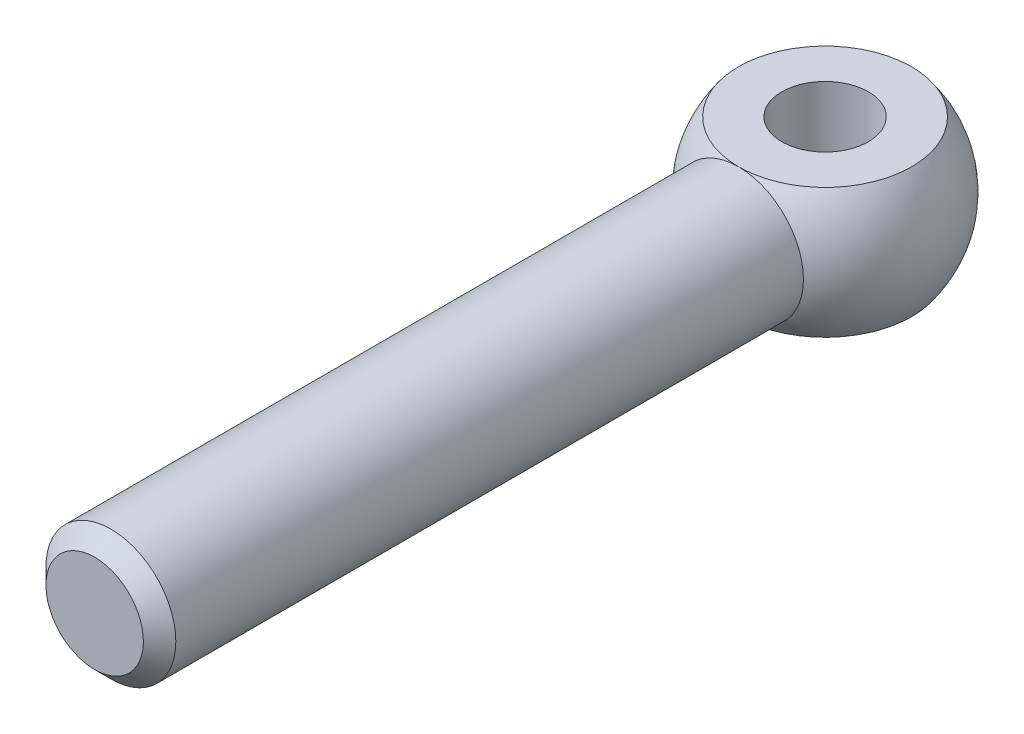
ISO-10303-21;
HEADER;
FILE_DESCRIPTION(('STEP AP214'),'2;1');
FILE_NAME('part.step','',(''),(''),'','','');
FILE_SCHEMA(('AUTOMOTIVE_DESIGN { 1 0 10303 214 1 1 1 1 }'));
ENDSEC;
DATA;
#1=APPLICATION_CONTEXT('core data for automotive mechanical design processes');
#2=APPLICATION_PROTOCOL_DEFINITION('international standard','automotive_design',2000,#1);
#3=PRODUCT_CONTEXT('',#1,'mechanical');
#4=PRODUCT('Part','Part','',(#3));
#5=PRODUCT_RELATED_PRODUCT_CATEGORY('part','',(#4));
#6=PRODUCT_DEFINITION_FORMATION('','',#4);
#7=PRODUCT_DEFINITION_CONTEXT('part definition',#1,'design');
#8=PRODUCT_DEFINITION('design','',#6,#7);
#9=PRODUCT_DEFINITION_SHAPE('','',#8);
#10=(LENGTH_UNIT() NAMED_UNIT(*) SI_UNIT(.MILLI.,.METRE.));
#11=(NAMED_UNIT(*) PLANE_ANGLE_UNIT() SI_UNIT($,.RADIAN.));
#12=(NAMED_UNIT(*) SI_UNIT($,.STERADIAN.) SOLID_ANGLE_UNIT());
#13=UNCERTAINTY_MEASURE_WITH_UNIT(LENGTH_MEASURE(1.E-05),#10,'distance_accuracy_value','');
#14=(GEOMETRIC_REPRESENTATION_CONTEXT(3) GLOBAL_UNCERTAINTY_ASSIGNED_CONTEXT((#13)) GLOBAL_UNIT_ASSIGNED_CONTEXT((#10,
#11,#12)) REPRESENTATION_CONTEXT('',''));
#15=CARTESIAN_POINT('',(0.,0.,0.));
#16=DIRECTION('',(0.,0.,1.));
#17=DIRECTION('',(1.,0.,0.));
#18=AXIS2_PLACEMENT_3D('',#15,#16,#17);
#19=CARTESIAN_POINT('',(0.,1.32360807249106,0.));
#20=DIRECTION('',(0.,1.,0.));
#21=DIRECTION('',(-1.,0.,0.));
#22=AXIS2_PLACEMENT_3D('',#19,#20,#21);
#23=CYLINDRICAL_SURFACE('',#22,8.);
#24=CARTESIAN_POINT('',(0.,-10.6763919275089,0.));
#25=DIRECTION('',(0.,1.,0.));
#26=DIRECTION('',(-1.,0.,0.));
#27=AXIS2_PLACEMENT_3D('',#24,#25,#26);
#28=CIRCLE('',#27,8.);
#29=CARTESIAN_POINT('',(-8.,-10.6763919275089,0.));
#30=VERTEX_POINT('',#29);
#31=EDGE_CURVE('E149',#30,#30,#28,.T.);
#32=ORIENTED_EDGE('',*,*,#31,.F.);
#33=EDGE_LOOP('',(#32));
#34=FACE_BOUND('',#33,.T.);
#35=CARTESIAN_POINT('',(0.,13.3236080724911,0.));
#36=DIRECTION('',(0.,1.,0.));
#37=DIRECTION('',(-1.,0.,0.));
#38=AXIS2_PLACEMENT_3D('',#35,#36,#37);
#39=CIRCLE('',#38,8.);
#40=CARTESIAN_POINT('',(-8.,13.3236080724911,0.));
#41=VERTEX_POINT('',#40);
#42=EDGE_CURVE('E151',#41,#41,#39,.F.);
#43=ORIENTED_EDGE('',*,*,#42,.F.);
#44=EDGE_LOOP('',(#43));
#45=FACE_BOUND('',#44,.T.);
#46=ADVANCED_FACE('F16',(#34,#45),#23,.F.);
#47=CARTESIAN_POINT('',(-12.,13.3236080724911,0.));
#48=DIRECTION('',(0.,1.,0.));
#49=DIRECTION('',(0.,0.,1.));
#50=AXIS2_PLACEMENT_3D('',#47,#48,#49);
#51=PLANE('',#50);
#52=ORIENTED_EDGE('',*,*,#42,.T.);
#53=EDGE_LOOP('',(#52));
#54=FACE_BOUND('',#53,.T.);
#55=CARTESIAN_POINT('',(0.,13.3236080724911,16.));
#56=CARTESIAN_POINT('',(-0.449525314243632,13.3236080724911,16.000003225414));
#57=CARTESIAN_POINT('',(-0.898997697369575,13.3236080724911,15.9810478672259));
#58=CARTESIAN_POINT('',(-1.79489771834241,13.3236080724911,15.9053587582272));
#59=CARTESIAN_POINT('',(-2.24132452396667,13.3236080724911,15.8486150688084));
#60=CARTESIAN_POINT('',(-3.12828472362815,13.3236080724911,15.697657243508));
#61=CARTESIAN_POINT('',(-3.56881125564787,13.3236080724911,15.6034028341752));
#62=CARTESIAN_POINT('',(-4.44035188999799,13.3236080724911,15.3780965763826));
#63=CARTESIAN_POINT('',(-4.87136602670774,13.3236080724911,15.247044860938));
#64=CARTESIAN_POINT('',(-5.72060724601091,13.3236080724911,14.9491486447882));
#65=CARTESIAN_POINT('',(-6.13884041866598,13.3236080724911,14.7823215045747));
#66=CARTESIAN_POINT('',(-6.95977089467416,13.3236080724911,14.4140204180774));
#67=CARTESIAN_POINT('',(-7.36246795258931,13.3236080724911,14.2125459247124));
#68=CARTESIAN_POINT('',(-8.14935486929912,13.3236080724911,13.7764403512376));
#69=CARTESIAN_POINT('',(-8.5335494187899,13.3236080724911,13.5418177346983));
#70=CARTESIAN_POINT('',(-9.28080899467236,13.3236080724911,13.0410458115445));
#71=CARTESIAN_POINT('',(-9.64387410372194,13.3236080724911,12.7748966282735));
#72=CARTESIAN_POINT('',(-10.3463332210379,13.3236080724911,12.2129326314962));
#73=CARTESIAN_POINT('',(-10.68572470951,13.3236080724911,11.9171146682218));
#74=CARTESIAN_POINT('',(-11.338381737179,13.3236080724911,11.2979393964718));
#75=CARTESIAN_POINT('',(-11.6516472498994,13.3236080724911,10.974582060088));
#76=CARTESIAN_POINT('',(-12.2498365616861,13.3236080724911,10.3026139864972));
#77=CARTESIAN_POINT('',(-12.5347592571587,13.3236080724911,9.95400226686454));
#78=CARTESIAN_POINT('',(-13.0742233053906,13.3236080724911,9.23401514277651));
#79=CARTESIAN_POINT('',(-13.3287646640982,13.3236080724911,8.86263974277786));
#80=CARTESIAN_POINT('',(-13.8056519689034,13.3236080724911,8.09977264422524));
#81=CARTESIAN_POINT('',(-14.0279985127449,13.3236080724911,7.70828131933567));
#82=CARTESIAN_POINT('',(-14.4389210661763,13.3236080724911,6.90795929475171));
#83=CARTESIAN_POINT('',(-14.6274970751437,13.3236080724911,6.49912859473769));
#84=CARTESIAN_POINT('',(-14.9695375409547,13.3236080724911,5.66703521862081));
#85=CARTESIAN_POINT('',(-15.1230020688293,13.3236080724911,5.243772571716));
#86=CARTESIAN_POINT('',(-15.3937290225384,13.3236080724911,4.38582365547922));
#87=CARTESIAN_POINT('',(-15.5109914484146,13.3236080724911,3.95113738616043));
#88=CARTESIAN_POINT('',(-15.7084807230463,13.3236080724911,3.07343073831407));
#89=CARTESIAN_POINT('',(-15.7887075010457,13.3236080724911,2.63041034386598));
#90=CARTESIAN_POINT('',(-15.9115547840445,13.3236080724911,1.73918586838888));
#91=CARTESIAN_POINT('',(-15.9541752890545,13.3236080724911,1.29098178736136));
#92=CARTESIAN_POINT('',(-16.0015069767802,13.3236080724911,0.392577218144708));
#93=CARTESIAN_POINT('',(-16.0062182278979,13.3236080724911,-0.0576232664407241));
#94=CARTESIAN_POINT('',(-15.9776980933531,13.3236080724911,-0.956820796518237));
#95=CARTESIAN_POINT('',(-15.9444667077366,13.3236080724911,-1.40581784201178));
#96=CARTESIAN_POINT('',(-15.8402975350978,13.3236080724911,-2.29941656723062));
#97=CARTESIAN_POINT('',(-15.7693597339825,13.3236080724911,-2.74401824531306));
#98=CARTESIAN_POINT('',(-15.5902820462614,13.3236080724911,-3.62566521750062));
#99=CARTESIAN_POINT('',(-15.4821421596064,13.3236080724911,-4.06271051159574));
#100=CARTESIAN_POINT('',(-15.2294289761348,13.3236080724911,-4.92613804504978));
#101=CARTESIAN_POINT('',(-15.0848556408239,13.3236080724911,-5.35252027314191));
#102=CARTESIAN_POINT('',(-14.7603034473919,13.3236080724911,-6.19158987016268));
#103=CARTESIAN_POINT('',(-14.5803245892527,13.3236080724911,-6.60427723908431));
#104=CARTESIAN_POINT('',(-14.1862409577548,13.3236080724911,-7.41302302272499));
#105=CARTESIAN_POINT('',(-13.9721361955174,13.3236080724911,-7.80908144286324));
#106=CARTESIAN_POINT('',(-13.5113228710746,13.3236080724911,-8.58175373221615));
#107=CARTESIAN_POINT('',(-13.2646143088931,13.3236080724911,-8.95836760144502));
#108=CARTESIAN_POINT('',(-12.7403474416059,13.3236080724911,-9.68947314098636));
#109=CARTESIAN_POINT('',(-12.4627891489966,13.3236080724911,-10.0439648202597));
#110=CARTESIAN_POINT('',(-11.8787960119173,13.3236080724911,-10.7283059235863));
#111=CARTESIAN_POINT('',(-11.5723611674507,13.3236080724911,-11.0581553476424));
#112=CARTESIAN_POINT('',(-10.9327934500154,13.3236080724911,-11.6908669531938));
#113=CARTESIAN_POINT('',(-10.5996605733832,13.3236080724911,-11.9937291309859));
#114=CARTESIAN_POINT('',(-9.90906520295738,13.3236080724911,-12.5703130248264));
#115=CARTESIAN_POINT('',(-9.55160270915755,13.3236080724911,-12.8440347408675));
#116=CARTESIAN_POINT('',(-8.81488940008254,13.3236080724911,-13.3603917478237));
#117=CARTESIAN_POINT('',(-8.43563858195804,13.3236080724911,-13.6030270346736));
#118=CARTESIAN_POINT('',(-7.65804491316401,13.3236080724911,-14.0554861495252));
#119=CARTESIAN_POINT('',(-7.25970206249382,13.3236080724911,-14.2653099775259));
#120=CARTESIAN_POINT('',(-6.44675632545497,13.3236080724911,-14.6506544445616));
#121=CARTESIAN_POINT('',(-6.03215343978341,13.3236080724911,-14.8261750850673));
#122=CARTESIAN_POINT('',(-5.18963519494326,13.3236080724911,-15.1416653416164));
#123=CARTESIAN_POINT('',(-4.7617198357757,13.3236080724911,-15.2816349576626));
#124=CARTESIAN_POINT('',(-3.89561888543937,13.3236080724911,-15.5250280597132));
#125=CARTESIAN_POINT('',(-3.45743329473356,13.3236080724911,-15.6284515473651));
#126=CARTESIAN_POINT('',(-2.57390709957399,13.3236080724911,-15.7980171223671));
#127=CARTESIAN_POINT('',(-2.12856649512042,13.3236080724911,-15.8641592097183));
#128=CARTESIAN_POINT('',(-1.23389637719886,13.3236080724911,-15.9586917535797));
#129=CARTESIAN_POINT('',(-0.784566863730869,13.3236080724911,-15.98708221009));
#130=CARTESIAN_POINT('',(0.114886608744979,13.3236080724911,-16.0059096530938));
#131=CARTESIAN_POINT('',(0.565010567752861,13.3236080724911,-15.9963466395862));
#132=CARTESIAN_POINT('',(1.46285284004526,13.3236080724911,-15.9393351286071));
#133=CARTESIAN_POINT('',(1.91057115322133,13.3236080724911,-15.8918866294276));
#134=CARTESIAN_POINT('',(2.80041910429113,13.3236080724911,-15.7594414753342));
#135=CARTESIAN_POINT('',(3.24254874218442,13.3236080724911,-15.6744448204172));
#136=CARTESIAN_POINT('',(4.11807608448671,13.3236080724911,-15.4675076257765));
#137=CARTESIAN_POINT('',(4.55147378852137,13.3236080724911,-15.3455670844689));
#138=CARTESIAN_POINT('',(5.40645604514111,13.3236080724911,-15.0656090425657));
#139=CARTESIAN_POINT('',(5.82804059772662,13.3236080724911,-14.9075915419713));
#140=CARTESIAN_POINT('',(6.65639928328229,13.3236080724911,-14.5566030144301));
#141=CARTESIAN_POINT('',(7.06317341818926,13.3236080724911,-14.3636319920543));
#142=CARTESIAN_POINT('',(7.85901940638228,13.3236080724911,-13.9441083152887));
#143=CARTESIAN_POINT('',(8.24809125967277,13.3236080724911,-13.7175556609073));
#144=CARTESIAN_POINT('',(9.00576656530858,13.3236080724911,-13.2324794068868));
#145=CARTESIAN_POINT('',(9.37437002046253,13.3236080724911,-12.9739558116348));
#146=CARTESIAN_POINT('',(10.0884880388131,13.3236080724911,-12.426775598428));
#147=CARTESIAN_POINT('',(10.4340026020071,13.3236080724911,-12.1381189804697));
#148=CARTESIAN_POINT('',(11.0994865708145,13.3236080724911,-11.532724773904));
#149=CARTESIAN_POINT('',(11.4194559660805,13.3236080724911,-11.2159871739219));
#150=CARTESIAN_POINT('',(12.0315746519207,13.3236080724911,-10.5566829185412));
#151=CARTESIAN_POINT('',(12.3237239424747,13.3236080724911,-10.2141162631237));
#152=CARTESIAN_POINT('',(12.8781255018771,13.3236080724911,-9.50558922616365));
#153=CARTESIAN_POINT('',(13.1403777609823,13.3236080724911,-9.13962883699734));
#154=CARTESIAN_POINT('',(13.6331206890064,13.3236080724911,-8.38691619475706));
#155=CARTESIAN_POINT('',(13.8636113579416,13.3236080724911,-8.00016394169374));
#156=CARTESIAN_POINT('',(14.2911922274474,13.3236080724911,-7.2086175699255));
#157=CARTESIAN_POINT('',(14.4882824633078,13.3236080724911,-6.80382347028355));
#158=CARTESIAN_POINT('',(14.8476615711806,13.3236080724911,-5.9790708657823));
#159=CARTESIAN_POINT('',(15.009950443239,13.3236080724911,-5.55911236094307));
#160=CARTESIAN_POINT('',(15.2985729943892,13.3236080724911,-4.70701675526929));
#161=CARTESIAN_POINT('',(15.4249066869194,13.3236080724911,-4.27487965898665));
#162=CARTESIAN_POINT('',(15.6407208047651,13.3236080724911,-3.40149895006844));
#163=CARTESIAN_POINT('',(15.7302012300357,13.3236080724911,-2.96025533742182));
#164=CARTESIAN_POINT('',(15.8716727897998,13.3236080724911,-2.07179776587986));
#165=CARTESIAN_POINT('',(15.9236638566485,13.3236080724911,-1.62458379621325));
#166=CARTESIAN_POINT('',(15.9897868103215,13.3236080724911,-0.727365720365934));
#167=CARTESIAN_POINT('',(16.003918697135,13.3236080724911,-0.277361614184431));
#168=CARTESIAN_POINT('',(15.9942228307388,13.3236080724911,0.622236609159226));
#169=CARTESIAN_POINT('',(15.97039515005,13.3236080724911,1.07183072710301));
#170=CARTESIAN_POINT('',(15.8849496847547,13.3236080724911,1.96741349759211));
#171=CARTESIAN_POINT('',(15.8233319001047,13.3236080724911,2.41340215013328));
#172=CARTESIAN_POINT('',(15.6627441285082,13.3236080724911,3.29860418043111));
#173=CARTESIAN_POINT('',(15.563774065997,13.3236080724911,3.73781754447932));
#174=CARTESIAN_POINT('',(15.3291853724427,13.3236080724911,4.60634551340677));
#175=CARTESIAN_POINT('',(15.1935667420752,13.3236080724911,5.03566011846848));
#176=CARTESIAN_POINT('',(14.8866422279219,13.3236080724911,5.88134626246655));
#177=CARTESIAN_POINT('',(14.7153356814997,13.3236080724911,6.29771756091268));
#178=CARTESIAN_POINT('',(14.3382547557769,13.3236080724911,7.11454856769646));
#179=CARTESIAN_POINT('',(14.1324803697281,13.3236080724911,7.51500827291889));
#180=CARTESIAN_POINT('',(13.6879354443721,13.3236080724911,8.29715362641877));
#181=CARTESIAN_POINT('',(13.4491661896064,13.3236080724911,8.67884000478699));
#182=CARTESIAN_POINT('',(12.9403231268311,13.3236080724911,9.42074158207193));
#183=CARTESIAN_POINT('',(12.6702493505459,13.3236080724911,9.78095680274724));
#184=CARTESIAN_POINT('',(12.1007473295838,13.3236080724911,10.4773186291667));
#185=CARTESIAN_POINT('',(11.8013222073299,13.3236080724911,10.8134677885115));
#186=CARTESIAN_POINT('',(11.175220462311,13.3236080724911,11.4593516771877));
#187=CARTESIAN_POINT('',(10.8485437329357,13.3236080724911,11.769086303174));
#188=CARTESIAN_POINT('',(10.1701750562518,13.3236080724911,12.3600135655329));
#189=CARTESIAN_POINT('',(9.81847675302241,13.3236080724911,12.6411989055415));
#190=CARTESIAN_POINT('',(9.09264578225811,13.3236080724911,13.1729337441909));
#191=CARTESIAN_POINT('',(8.71851346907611,13.3236080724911,13.4234837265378));
#192=CARTESIAN_POINT('',(7.95028297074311,13.3236080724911,13.8922850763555));
#193=CARTESIAN_POINT('',(7.5561752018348,13.3236080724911,14.1105207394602));
#194=CARTESIAN_POINT('',(6.75096709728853,13.3236080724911,14.5129954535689));
#195=CARTESIAN_POINT('',(6.33986670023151,13.3236080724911,14.6972343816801));
#196=CARTESIAN_POINT('',(5.50404141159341,13.3236080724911,15.0302249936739));
#197=CARTESIAN_POINT('',(5.07933164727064,13.3236080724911,15.1790146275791));
#198=CARTESIAN_POINT('',(4.21903350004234,13.3236080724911,15.4402669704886));
#199=CARTESIAN_POINT('',(3.78344800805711,13.3236080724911,15.5527392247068));
#200=CARTESIAN_POINT('',(2.7948527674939,13.3236080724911,15.7640042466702));
#201=CARTESIAN_POINT('',(2.23959667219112,13.3236080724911,15.8524275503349));
#202=CARTESIAN_POINT('',(1.12286620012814,13.3236080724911,15.970423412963));
#203=CARTESIAN_POINT('',(0.561391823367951,13.3236080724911,15.9999959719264));
#204=CARTESIAN_POINT('',(0.,13.3236080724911,16.));
#205=B_SPLINE_CURVE_WITH_KNOTS('',3,(#55,#56,#57,#58,#59,#60,#61,#62,#63,#64,#65,#66,#67,#68,
#69,#70,#71,#72,#73,#74,#75,#76,#77,#78,#79,#80,#81,#82,#83,#84,#85,#86,#87,#88,#89,#90,#91,#92,
#93,#94,#95,#96,#97,#98,#99,#100,#101,#102,#103,#104,#105,#106,#107,#108,#109,#110,#111,#112,
#113,#114,#115,#116,#117,#118,#119,#120,#121,#122,#123,#124,#125,#126,#127,#128,#129,#130,#131,
#132,#133,#134,#135,#136,#137,#138,#139,#140,#141,#142,#143,#144,#145,#146,#147,#148,#149,#150,
#151,#152,#153,#154,#155,#156,#157,#158,#159,#160,#161,#162,#163,#164,#165,#166,#167,#168,#169,
#170,#171,#172,#173,#174,#175,#176,#177,#178,#179,#180,#181,#182,#183,#184,#185,#186,#187,#188,
#189,#190,#191,#192,#193,#194,#195,#196,#197,#198,#199,#200,#201,#202,#203,#204),.UNSPECIFIED.,
.T.,.F.,(4,2,2,2,2,2,2,2,2,2,2,2,2,2,2,2,2,2,2,2,2,2,2,2,2,2,2,2,2,2,2,2,2,2,2,2,2,2,2,2,2,2,2,
2,2,2,2,2,2,2,2,2,2,2,2,2,2,2,2,2,2,2,2,2,2,2,2,2,2,2,2,2,2,2,4),(0.,1.34808556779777,
2.69652583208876,4.04641777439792,5.39630483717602,6.74553832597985,8.09479312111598,
9.44370403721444,10.7926096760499,12.1416586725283,13.4907090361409,14.839811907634,
16.1889145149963,17.5379920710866,18.8870696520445,20.2361445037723,21.5852193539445,
22.9342967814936,24.2833742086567,25.6324492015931,26.9815241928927,28.3305996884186,
29.67967518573,31.0287521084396,32.3778290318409,33.7269055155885,35.0759819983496,
36.4250579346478,37.7741338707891,39.1232099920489,40.4722861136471,41.8213624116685,
43.1704387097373,44.5195149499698,45.8685911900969,47.2176673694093,48.5667435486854,
49.9158197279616,51.264895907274,52.6139721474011,53.9630483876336,55.3121246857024,
56.6612009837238,58.010277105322,59.3593532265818,60.7084291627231,62.0575050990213,
63.4065815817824,64.75565806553,66.1047349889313,67.4538119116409,68.8028874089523,
70.1519629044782,71.5010378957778,72.8501128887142,74.1991903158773,75.5482677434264,
76.8973425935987,78.2464174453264,79.5954950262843,80.9445725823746,82.2936751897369,
83.64277806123,84.9918284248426,86.340877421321,87.6897830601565,89.0386939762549,
90.3879487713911,91.7371822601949,93.087069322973,94.4369612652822,95.7854015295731,
97.1334870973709,98.8170501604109,100.500613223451),.UNSPECIFIED.);
#206=CARTESIAN_POINT('',(0.,13.3236080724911,16.));
#207=VERTEX_POINT('',#206);
#208=EDGE_CURVE('E52',#207,#207,#205,.T.);
#209=ORIENTED_EDGE('',*,*,#208,.F.);
#210=EDGE_LOOP('',(#209));
#211=FACE_BOUND('',#210,.T.);
#212=ADVANCED_FACE('F118',(#54,#211),#51,.T.);
#213=CARTESIAN_POINT('',(-12.,-10.6763919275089,0.));
#214=DIRECTION('',(0.,-1.,0.));
#215=DIRECTION('',(0.,0.,-1.));
#216=AXIS2_PLACEMENT_3D('',#213,#214,#215);
#217=PLANE('',#216);
#218=ORIENTED_EDGE('',*,*,#31,.T.);
#219=EDGE_LOOP('',(#218));
#220=FACE_BOUND('',#219,.T.);
#221=CARTESIAN_POINT('',(0.,-10.6763919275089,16.));
#222=CARTESIAN_POINT('',(0.449525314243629,-10.6763919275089,16.000003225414));
#223=CARTESIAN_POINT('',(0.898997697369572,-10.6763919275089,15.9810478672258));
#224=CARTESIAN_POINT('',(1.79489771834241,-10.6763919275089,15.9053587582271));
#225=CARTESIAN_POINT('',(2.24132452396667,-10.6763919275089,15.8486150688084));
#226=CARTESIAN_POINT('',(3.12828472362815,-10.6763919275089,15.697657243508));
#227=CARTESIAN_POINT('',(3.56881125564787,-10.6763919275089,15.6034028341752));
#228=CARTESIAN_POINT('',(4.44035188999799,-10.6763919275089,15.3780965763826));
#229=CARTESIAN_POINT('',(4.87136602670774,-10.6763919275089,15.247044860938));
#230=CARTESIAN_POINT('',(5.72060724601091,-10.6763919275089,14.9491486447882));
#231=CARTESIAN_POINT('',(6.13884041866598,-10.6763919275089,14.7823215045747));
#232=CARTESIAN_POINT('',(6.95977089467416,-10.6763919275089,14.4140204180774));
#233=CARTESIAN_POINT('',(7.36246795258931,-10.6763919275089,14.2125459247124));
#234=CARTESIAN_POINT('',(8.14935486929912,-10.6763919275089,13.7764403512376));
#235=CARTESIAN_POINT('',(8.5335494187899,-10.6763919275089,13.5418177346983));
#236=CARTESIAN_POINT('',(9.28080899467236,-10.6763919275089,13.0410458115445));
#237=CARTESIAN_POINT('',(9.64387410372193,-10.6763919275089,12.7748966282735));
#238=CARTESIAN_POINT('',(10.3463332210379,-10.6763919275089,12.2129326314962));
#239=CARTESIAN_POINT('',(10.6857247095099,-10.6763919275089,11.9171146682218));
#240=CARTESIAN_POINT('',(11.338381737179,-10.6763919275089,11.2979393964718));
#241=CARTESIAN_POINT('',(11.6516472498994,-10.6763919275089,10.974582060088));
#242=CARTESIAN_POINT('',(12.2498365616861,-10.6763919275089,10.3026139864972));
#243=CARTESIAN_POINT('',(12.5347592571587,-10.6763919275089,9.95400226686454));
#244=CARTESIAN_POINT('',(13.0742233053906,-10.6763919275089,9.2340151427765));
#245=CARTESIAN_POINT('',(13.3287646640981,-10.6763919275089,8.86263974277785));
#246=CARTESIAN_POINT('',(13.8056519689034,-10.6763919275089,8.09977264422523));
#247=CARTESIAN_POINT('',(14.0279985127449,-10.6763919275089,7.70828131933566));
#248=CARTESIAN_POINT('',(14.4389210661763,-10.6763919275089,6.9079592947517));
#249=CARTESIAN_POINT('',(14.6274970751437,-10.6763919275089,6.49912859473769));
#250=CARTESIAN_POINT('',(14.9695375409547,-10.6763919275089,5.66703521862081));
#251=CARTESIAN_POINT('',(15.1230020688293,-10.6763919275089,5.24377257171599));
#252=CARTESIAN_POINT('',(15.3937290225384,-10.6763919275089,4.38582365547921));
#253=CARTESIAN_POINT('',(15.5109914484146,-10.6763919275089,3.95113738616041));
#254=CARTESIAN_POINT('',(15.7084807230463,-10.6763919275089,3.07343073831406));
#255=CARTESIAN_POINT('',(15.7887075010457,-10.6763919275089,2.63041034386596));
#256=CARTESIAN_POINT('',(15.9115547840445,-10.6763919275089,1.73918586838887));
#257=CARTESIAN_POINT('',(15.9541752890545,-10.6763919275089,1.29098178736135));
#258=CARTESIAN_POINT('',(16.0015069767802,-10.6763919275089,0.392577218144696));
#259=CARTESIAN_POINT('',(16.0062182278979,-10.6763919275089,-0.0576232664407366));
#260=CARTESIAN_POINT('',(15.9776980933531,-10.6763919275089,-0.956820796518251));
#261=CARTESIAN_POINT('',(15.9444667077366,-10.6763919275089,-1.40581784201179));
#262=CARTESIAN_POINT('',(15.8402975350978,-10.6763919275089,-2.29941656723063));
#263=CARTESIAN_POINT('',(15.7693597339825,-10.6763919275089,-2.74401824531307));
#264=CARTESIAN_POINT('',(15.5902820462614,-10.6763919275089,-3.62566521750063));
#265=CARTESIAN_POINT('',(15.4821421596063,-10.6763919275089,-4.06271051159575));
#266=CARTESIAN_POINT('',(15.2294289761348,-10.6763919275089,-4.92613804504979));
#267=CARTESIAN_POINT('',(15.0848556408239,-10.6763919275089,-5.35252027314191));
#268=CARTESIAN_POINT('',(14.7603034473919,-10.6763919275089,-6.19158987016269));
#269=CARTESIAN_POINT('',(14.5803245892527,-10.6763919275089,-6.60427723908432));
#270=CARTESIAN_POINT('',(14.1862409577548,-10.6763919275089,-7.413023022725));
#271=CARTESIAN_POINT('',(13.9721361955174,-10.6763919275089,-7.80908144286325));
#272=CARTESIAN_POINT('',(13.5113228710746,-10.6763919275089,-8.58175373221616));
#273=CARTESIAN_POINT('',(13.264614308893,-10.6763919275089,-8.95836760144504));
#274=CARTESIAN_POINT('',(12.7403474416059,-10.6763919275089,-9.68947314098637));
#275=CARTESIAN_POINT('',(12.4627891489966,-10.6763919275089,-10.0439648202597));
#276=CARTESIAN_POINT('',(11.8787960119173,-10.6763919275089,-10.7283059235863));
#277=CARTESIAN_POINT('',(11.5723611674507,-10.6763919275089,-11.0581553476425));
#278=CARTESIAN_POINT('',(10.9327934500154,-10.6763919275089,-11.6908669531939));
#279=CARTESIAN_POINT('',(10.5996605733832,-10.6763919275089,-11.9937291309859));
#280=CARTESIAN_POINT('',(9.90906520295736,-10.6763919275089,-12.5703130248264));
#281=CARTESIAN_POINT('',(9.55160270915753,-10.6763919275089,-12.8440347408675));
#282=CARTESIAN_POINT('',(8.81488940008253,-10.6763919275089,-13.3603917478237));
#283=CARTESIAN_POINT('',(8.43563858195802,-10.6763919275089,-13.6030270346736));
#284=CARTESIAN_POINT('',(7.65804491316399,-10.6763919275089,-14.0554861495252));
#285=CARTESIAN_POINT('',(7.2597020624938,-10.6763919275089,-14.2653099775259));
#286=CARTESIAN_POINT('',(6.44675632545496,-10.6763919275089,-14.6506544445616));
#287=CARTESIAN_POINT('',(6.03215343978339,-10.6763919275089,-14.8261750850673));
#288=CARTESIAN_POINT('',(5.18963519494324,-10.6763919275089,-15.1416653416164));
#289=CARTESIAN_POINT('',(4.76171983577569,-10.6763919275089,-15.2816349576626));
#290=CARTESIAN_POINT('',(3.89561888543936,-10.6763919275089,-15.5250280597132));
#291=CARTESIAN_POINT('',(3.45743329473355,-10.6763919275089,-15.6284515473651));
#292=CARTESIAN_POINT('',(2.57390709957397,-10.6763919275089,-15.7980171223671));
#293=CARTESIAN_POINT('',(2.1285664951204,-10.6763919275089,-15.8641592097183));
#294=CARTESIAN_POINT('',(1.23389637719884,-10.6763919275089,-15.9586917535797));
#295=CARTESIAN_POINT('',(0.784566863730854,-10.6763919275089,-15.98708221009));
#296=CARTESIAN_POINT('',(-0.114886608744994,-10.6763919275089,-16.0059096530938));
#297=CARTESIAN_POINT('',(-0.565010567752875,-10.6763919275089,-15.9963466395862));
#298=CARTESIAN_POINT('',(-1.46285284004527,-10.6763919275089,-15.9393351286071));
#299=CARTESIAN_POINT('',(-1.91057115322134,-10.6763919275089,-15.8918866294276));
#300=CARTESIAN_POINT('',(-2.80041910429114,-10.6763919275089,-15.7594414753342));
#301=CARTESIAN_POINT('',(-3.24254874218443,-10.6763919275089,-15.6744448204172));
#302=CARTESIAN_POINT('',(-4.11807608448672,-10.6763919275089,-15.4675076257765));
#303=CARTESIAN_POINT('',(-4.55147378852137,-10.6763919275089,-15.3455670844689));
#304=CARTESIAN_POINT('',(-5.40645604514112,-10.6763919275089,-15.0656090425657));
#305=CARTESIAN_POINT('',(-5.82804059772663,-10.6763919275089,-14.9075915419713));
#306=CARTESIAN_POINT('',(-6.6563992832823,-10.6763919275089,-14.5566030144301));
#307=CARTESIAN_POINT('',(-7.06317341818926,-10.6763919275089,-14.3636319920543));
#308=CARTESIAN_POINT('',(-7.85901940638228,-10.6763919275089,-13.9441083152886));
#309=CARTESIAN_POINT('',(-8.24809125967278,-10.6763919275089,-13.7175556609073));
#310=CARTESIAN_POINT('',(-9.00576656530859,-10.6763919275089,-13.2324794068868));
#311=CARTESIAN_POINT('',(-9.37437002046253,-10.6763919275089,-12.9739558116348));
#312=CARTESIAN_POINT('',(-10.0884880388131,-10.6763919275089,-12.426775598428));
#313=CARTESIAN_POINT('',(-10.4340026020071,-10.6763919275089,-12.1381189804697));
#314=CARTESIAN_POINT('',(-11.0994865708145,-10.6763919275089,-11.532724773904));
#315=CARTESIAN_POINT('',(-11.4194559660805,-10.6763919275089,-11.2159871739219));
#316=CARTESIAN_POINT('',(-12.0315746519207,-10.6763919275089,-10.5566829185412));
#317=CARTESIAN_POINT('',(-12.3237239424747,-10.6763919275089,-10.2141162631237));
#318=CARTESIAN_POINT('',(-12.8781255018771,-10.6763919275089,-9.50558922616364));
#319=CARTESIAN_POINT('',(-13.1403777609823,-10.6763919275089,-9.13962883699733));
#320=CARTESIAN_POINT('',(-13.6331206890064,-10.6763919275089,-8.38691619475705));
#321=CARTESIAN_POINT('',(-13.8636113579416,-10.6763919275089,-8.00016394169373));
#322=CARTESIAN_POINT('',(-14.2911922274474,-10.6763919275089,-7.20861756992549));
#323=CARTESIAN_POINT('',(-14.4882824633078,-10.6763919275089,-6.80382347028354));
#324=CARTESIAN_POINT('',(-14.8476615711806,-10.6763919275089,-5.97907086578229));
#325=CARTESIAN_POINT('',(-15.009950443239,-10.6763919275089,-5.55911236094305));
#326=CARTESIAN_POINT('',(-15.2985729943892,-10.6763919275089,-4.70701675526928));
#327=CARTESIAN_POINT('',(-15.4249066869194,-10.6763919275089,-4.27487965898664));
#328=CARTESIAN_POINT('',(-15.6407208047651,-10.6763919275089,-3.40149895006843));
#329=CARTESIAN_POINT('',(-15.7302012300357,-10.6763919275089,-2.96025533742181));
#330=CARTESIAN_POINT('',(-15.8716727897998,-10.6763919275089,-2.07179776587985));
#331=CARTESIAN_POINT('',(-15.9236638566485,-10.6763919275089,-1.62458379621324));
#332=CARTESIAN_POINT('',(-15.9897868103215,-10.6763919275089,-0.727365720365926));
#333=CARTESIAN_POINT('',(-16.003918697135,-10.6763919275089,-0.277361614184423));
#334=CARTESIAN_POINT('',(-15.9942228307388,-10.6763919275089,0.622236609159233));
#335=CARTESIAN_POINT('',(-15.97039515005,-10.6763919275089,1.07183072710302));
#336=CARTESIAN_POINT('',(-15.8849496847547,-10.6763919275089,1.96741349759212));
#337=CARTESIAN_POINT('',(-15.8233319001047,-10.6763919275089,2.41340215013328));
#338=CARTESIAN_POINT('',(-15.6627441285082,-10.6763919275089,3.29860418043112));
#339=CARTESIAN_POINT('',(-15.563774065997,-10.6763919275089,3.73781754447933));
#340=CARTESIAN_POINT('',(-15.3291853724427,-10.6763919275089,4.60634551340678));
#341=CARTESIAN_POINT('',(-15.1935667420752,-10.6763919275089,5.03566011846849));
#342=CARTESIAN_POINT('',(-14.8866422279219,-10.6763919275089,5.88134626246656));
#343=CARTESIAN_POINT('',(-14.7153356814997,-10.6763919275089,6.29771756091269));
#344=CARTESIAN_POINT('',(-14.3382547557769,-10.6763919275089,7.11454856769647));
#345=CARTESIAN_POINT('',(-14.1324803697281,-10.6763919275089,7.51500827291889));
#346=CARTESIAN_POINT('',(-13.6879354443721,-10.6763919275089,8.29715362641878));
#347=CARTESIAN_POINT('',(-13.4491661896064,-10.6763919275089,8.678840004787));
#348=CARTESIAN_POINT('',(-12.9403231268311,-10.6763919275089,9.42074158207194));
#349=CARTESIAN_POINT('',(-12.6702493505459,-10.6763919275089,9.78095680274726));
#350=CARTESIAN_POINT('',(-12.1007473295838,-10.6763919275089,10.4773186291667));
#351=CARTESIAN_POINT('',(-11.8013222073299,-10.6763919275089,10.8134677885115));
#352=CARTESIAN_POINT('',(-11.175220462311,-10.6763919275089,11.4593516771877));
#353=CARTESIAN_POINT('',(-10.8485437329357,-10.6763919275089,11.769086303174));
#354=CARTESIAN_POINT('',(-10.1701750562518,-10.6763919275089,12.3600135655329));
#355=CARTESIAN_POINT('',(-9.81847675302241,-10.6763919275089,12.6411989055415));
#356=CARTESIAN_POINT('',(-9.09264578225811,-10.6763919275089,13.1729337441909));
#357=CARTESIAN_POINT('',(-8.7185134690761,-10.6763919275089,13.4234837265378));
#358=CARTESIAN_POINT('',(-7.9502829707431,-10.6763919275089,13.8922850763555));
#359=CARTESIAN_POINT('',(-7.55617520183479,-10.6763919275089,14.1105207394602));
#360=CARTESIAN_POINT('',(-6.75096709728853,-10.6763919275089,14.5129954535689));
#361=CARTESIAN_POINT('',(-6.3398667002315,-10.6763919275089,14.6972343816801));
#362=CARTESIAN_POINT('',(-5.5040414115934,-10.6763919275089,15.0302249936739));
#363=CARTESIAN_POINT('',(-5.07933164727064,-10.6763919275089,15.1790146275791));
#364=CARTESIAN_POINT('',(-4.21903350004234,-10.6763919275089,15.4402669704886));
#365=CARTESIAN_POINT('',(-3.7834480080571,-10.6763919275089,15.5527392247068));
#366=CARTESIAN_POINT('',(-2.7948527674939,-10.6763919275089,15.7640042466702));
#367=CARTESIAN_POINT('',(-2.23959667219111,-10.6763919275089,15.8524275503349));
#368=CARTESIAN_POINT('',(-1.12286620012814,-10.6763919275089,15.970423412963));
#369=CARTESIAN_POINT('',(-0.561391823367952,-10.6763919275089,15.9999959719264));
#370=CARTESIAN_POINT('',(0.,-10.6763919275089,16.));
#371=B_SPLINE_CURVE_WITH_KNOTS('',3,(#221,#222,#223,#224,#225,#226,#227,#228,#229,#230,#231,
#232,#233,#234,#235,#236,#237,#238,#239,#240,#241,#242,#243,#244,#245,#246,#247,#248,#249,#250,
#251,#252,#253,#254,#255,#256,#257,#258,#259,#260,#261,#262,#263,#264,#265,#266,#267,#268,#269,
#270,#271,#272,#273,#274,#275,#276,#277,#278,#279,#280,#281,#282,#283,#284,#285,#286,#287,#288,
#289,#290,#291,#292,#293,#294,#295,#296,#297,#298,#299,#300,#301,#302,#303,#304,#305,#306,#307,
#308,#309,#310,#311,#312,#313,#314,#315,#316,#317,#318,#319,#320,#321,#322,#323,#324,#325,#326,
#327,#328,#329,#330,#331,#332,#333,#334,#335,#336,#337,#338,#339,#340,#341,#342,#343,#344,#345,
#346,#347,#348,#349,#350,#351,#352,#353,#354,#355,#356,#357,#358,#359,#360,#361,#362,#363,#364,
#365,#366,#367,#368,#369,#370),.UNSPECIFIED.,.T.,.F.,(4,2,2,2,2,2,2,2,2,2,2,2,2,2,2,2,2,2,2,2,2,
2,2,2,2,2,2,2,2,2,2,2,2,2,2,2,2,2,2,2,2,2,2,2,2,2,2,2,2,2,2,2,2,2,2,2,2,2,2,2,2,2,2,2,2,2,2,2,2,
2,2,2,2,2,4),(0.,1.34808556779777,2.69652583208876,4.04641777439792,5.39630483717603,
6.74553832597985,8.09479312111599,9.44370403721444,10.7926096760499,12.1416586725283,
13.4907090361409,14.839811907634,16.1889145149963,17.5379920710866,18.8870696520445,
20.2361445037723,21.5852193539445,22.9342967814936,24.2833742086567,25.6324492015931,
26.9815241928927,28.3305996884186,29.67967518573,31.0287521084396,32.3778290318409,
33.7269055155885,35.0759819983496,36.4250579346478,37.7741338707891,39.1232099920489,
40.4722861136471,41.8213624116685,43.1704387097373,44.5195149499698,45.8685911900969,
47.2176673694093,48.5667435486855,49.9158197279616,51.264895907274,52.6139721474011,
53.9630483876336,55.3121246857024,56.6612009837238,58.010277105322,59.3593532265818,
60.7084291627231,62.0575050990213,63.4065815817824,64.75565806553,66.1047349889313,
67.4538119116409,68.8028874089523,70.1519629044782,71.5010378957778,72.8501128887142,
74.1991903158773,75.5482677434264,76.8973425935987,78.2464174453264,79.5954950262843,
80.9445725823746,82.2936751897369,83.64277806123,84.9918284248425,86.3408774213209,
87.6897830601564,89.0386939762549,90.387948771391,91.7371822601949,93.087069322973,
94.4369612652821,95.7854015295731,97.1334870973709,98.8170501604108,100.500613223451),.UNSPECIFIED.);
#372=CARTESIAN_POINT('',(0.,-10.6763919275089,16.));
#373=VERTEX_POINT('',#372);
#374=EDGE_CURVE('E105',#373,#373,#371,.T.);
#375=ORIENTED_EDGE('',*,*,#374,.F.);
#376=EDGE_LOOP('',(#375));
#377=FACE_BOUND('',#376,.T.);
#378=ADVANCED_FACE('F115',(#220,#377),#217,.T.);
#379=CARTESIAN_POINT('',(0.,1.32360807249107,135.));
#380=DIRECTION('',(0.,0.,-1.));
#381=DIRECTION('',(-1.,0.,0.));
#382=AXIS2_PLACEMENT_3D('',#379,#380,#381);
#383=PLANE('',#382);
#384=CARTESIAN_POINT('',(0.,1.32360807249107,135.000000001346));
#385=DIRECTION('',(0.,0.,-1.));
#386=DIRECTION('',(0.,1.,0.));
#387=AXIS2_PLACEMENT_3D('',#384,#385,#386);
#388=CIRCLE('',#387,9.00000000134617);
#389=CARTESIAN_POINT('',(0.,10.3236080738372,135.000000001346));
#390=VERTEX_POINT('',#389);
#391=EDGE_CURVE('E101',#390,#390,#388,.T.);
#392=ORIENTED_EDGE('',*,*,#391,.F.);
#393=EDGE_LOOP('',(#392));
#394=FACE_BOUND('',#393,.T.);
#395=ADVANCED_FACE('F67',(#394),#383,.F.);
#396=CARTESIAN_POINT('',(0.,1.32360807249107,0.));
#397=DIRECTION('',(1.,0.,0.));
#398=DIRECTION('',(0.,1.,0.));
#399=AXIS2_PLACEMENT_3D('',#396,#397,#398);
#400=SPHERICAL_SURFACE('',#399,20.);
#401=ORIENTED_EDGE('',*,*,#374,.T.);
#402=CARTESIAN_POINT('',(0.,1.32360807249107,16.));
#403=DIRECTION('',(0.,0.,1.));
#404=DIRECTION('',(1.,0.,0.));
#405=AXIS2_PLACEMENT_3D('',#402,#403,#404);
#406=CIRCLE('',#405,12.);
#407=EDGE_CURVE('E96',#207,#373,#406,.T.);
#408=ORIENTED_EDGE('',*,*,#407,.F.);
#409=ORIENTED_EDGE('',*,*,#208,.T.);
#410=CARTESIAN_POINT('',(0.,1.32360807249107,16.));
#411=DIRECTION('',(0.,0.,1.));
#412=DIRECTION('',(1.,0.,0.));
#413=AXIS2_PLACEMENT_3D('',#410,#411,#412);
#414=CIRCLE('',#413,12.);
#415=CARTESIAN_POINT('',(12.,1.32360807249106,16.));
#416=VERTEX_POINT('',#415);
#417=EDGE_CURVE('E37',#416,#207,#414,.T.);
#418=ORIENTED_EDGE('',*,*,#417,.F.);
#419=CARTESIAN_POINT('',(20.,1.32360807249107,0.));
#420=CARTESIAN_POINT('',(20.0000134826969,1.32360807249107,0.386373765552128));
#421=CARTESIAN_POINT('',(19.988804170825,1.32360807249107,0.772746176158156));
#422=CARTESIAN_POINT('',(19.944036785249,1.32360807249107,1.54419430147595));
#423=CARTESIAN_POINT('',(19.9104787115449,1.32360807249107,1.92927001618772));
#424=CARTESIAN_POINT('',(19.8211106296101,1.32360807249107,2.69683076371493));
#425=CARTESIAN_POINT('',(19.7653006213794,1.32360807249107,3.07931579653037));
#426=CARTESIAN_POINT('',(19.631620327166,1.32360807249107,3.84041106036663));
#427=CARTESIAN_POINT('',(19.5537500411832,1.32360807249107,4.21902129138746));
#428=CARTESIAN_POINT('',(19.376209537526,1.32360807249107,4.97109553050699));
#429=CARTESIAN_POINT('',(19.2765393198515,1.32360807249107,5.3445595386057));
#430=CARTESIAN_POINT('',(19.0557339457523,1.32360807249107,6.08508727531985));
#431=CARTESIAN_POINT('',(18.9345987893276,1.32360807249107,6.45215100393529));
#432=CARTESIAN_POINT('',(18.6712702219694,1.32360807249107,7.17864559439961));
#433=CARTESIAN_POINT('',(18.5290768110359,1.32360807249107,7.53807645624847));
#434=CARTESIAN_POINT('',(18.2241092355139,1.32360807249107,8.24809836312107));
#435=CARTESIAN_POINT('',(18.0613350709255,1.32360807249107,8.5986894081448));
#436=CARTESIAN_POINT('',(17.7157525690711,1.32360807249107,9.28985441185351));
#437=CARTESIAN_POINT('',(17.5329442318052,1.32360807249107,9.6304283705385));
#438=CARTESIAN_POINT('',(17.1479072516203,1.32360807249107,10.3004155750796));
#439=CARTESIAN_POINT('',(16.9456786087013,1.32360807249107,10.6298288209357));
#440=CARTESIAN_POINT('',(16.5224800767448,1.32360807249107,11.2763884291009));
#441=CARTESIAN_POINT('',(16.3015101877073,1.32360807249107,11.5935347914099));
#442=CARTESIAN_POINT('',(15.8415712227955,1.32360807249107,12.2144957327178));
#443=CARTESIAN_POINT('',(15.6026021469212,1.32360807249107,12.5183103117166));
#444=CARTESIAN_POINT('',(15.1074670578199,1.32360807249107,13.1115872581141));
#445=CARTESIAN_POINT('',(14.8513010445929,1.32360807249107,13.4010496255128));
#446=CARTESIAN_POINT('',(14.322633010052,1.32360807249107,13.9646510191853));
#447=CARTESIAN_POINT('',(14.050130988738,1.32360807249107,14.2387900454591));
#448=CARTESIAN_POINT('',(13.4897032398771,1.32360807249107,14.7708209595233));
#449=CARTESIAN_POINT('',(13.2017775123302,1.32360807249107,15.0287128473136));
#450=CARTESIAN_POINT('',(12.6114794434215,1.32360807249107,15.5273956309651));
#451=CARTESIAN_POINT('',(12.3091071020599,1.32360807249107,15.7681865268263));
#452=CARTESIAN_POINT('',(12.,1.32360807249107,16.));
#453=B_SPLINE_CURVE_WITH_KNOTS('',3,(#419,#420,#421,#422,#423,#424,#425,#426,#427,#428,#429,
#430,#431,#432,#433,#434,#435,#436,#437,#438,#439,#440,#441,#442,#443,#444,#445,#446,#447,#448,
#449,#450,#451,#452),.UNSPECIFIED.,.F.,.F.,(4,2,2,2,2,2,2,2,2,2,2,2,2,2,2,2,4),(0.,
1.15895680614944,2.31791361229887,3.47687041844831,4.63582722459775,5.79478403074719,
6.95374083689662,8.11269764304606,9.2716544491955,10.4306112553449,11.5895680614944,
12.7485248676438,13.9074816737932,15.0664384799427,16.2253952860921,17.3843520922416,
18.543308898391),.UNSPECIFIED.);
#454=CARTESIAN_POINT('',(20.,1.32360807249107,0.));
#455=VERTEX_POINT('',#454);
#456=EDGE_CURVE('E50',#455,#416,#453,.T.);
#457=ORIENTED_EDGE('',*,*,#456,.F.);
#458=CARTESIAN_POINT('',(-20.,1.32360807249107,0.));
#459=CARTESIAN_POINT('',(-20.0000069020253,1.32360807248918,-0.326779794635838));
#460=CARTESIAN_POINT('',(-19.9919913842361,1.32360807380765,-0.65355900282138));
#461=CARTESIAN_POINT('',(-19.9599650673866,1.32360807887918,-1.30633275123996));
#462=CARTESIAN_POINT('',(-19.9359542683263,1.32360808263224,-1.632327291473));
#463=CARTESIAN_POINT('',(-19.8719869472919,1.32360809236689,-2.28274820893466));
#464=CARTESIAN_POINT('',(-19.8320304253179,1.32360809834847,-2.60717458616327));
#465=CARTESIAN_POINT('',(-19.7362698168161,1.32360811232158,-3.25367995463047));
#466=CARTESIAN_POINT('',(-19.6804657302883,1.32360812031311,-3.57575894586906));
#467=CARTESIAN_POINT('',(-19.5531434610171,1.32360813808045,-4.21679582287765));
#468=CARTESIAN_POINT('',(-19.4816252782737,1.32360814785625,-4.53575370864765));
#469=CARTESIAN_POINT('',(-19.3230467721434,1.32360816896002,-5.16978218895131));
#470=CARTESIAN_POINT('',(-19.2359864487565,1.32360818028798,-5.48485278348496));
#471=CARTESIAN_POINT('',(-19.0465327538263,1.32360820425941,-6.11034982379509));
#472=CARTESIAN_POINT('',(-18.944139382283,1.32360821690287,-6.42077626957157));
#473=CARTESIAN_POINT('',(-18.7242655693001,1.32360824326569,-7.03623931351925));
#474=CARTESIAN_POINT('',(-18.6067851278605,1.32360825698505,-7.34127591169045));
#475=CARTESIAN_POINT('',(-18.3570193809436,1.3236082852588,-7.94522650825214));
#476=CARTESIAN_POINT('',(-18.2247340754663,1.32360829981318,-8.24414050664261));
#477=CARTESIAN_POINT('',(-17.9456763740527,1.32360832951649,-8.83512785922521));
#478=CARTESIAN_POINT('',(-17.7989039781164,1.32360834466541,-9.12720121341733));
#479=CARTESIAN_POINT('',(-17.4912246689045,1.32360837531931,-9.70380566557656));
#480=CARTESIAN_POINT('',(-17.3303177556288,1.32360839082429,-9.98833676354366));
#481=CARTESIAN_POINT('',(-16.9947559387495,1.32360842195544,-10.5491732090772));
#482=CARTESIAN_POINT('',(-16.8201010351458,1.32360843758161,-10.8254785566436));
#483=CARTESIAN_POINT('',(-16.4574627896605,1.32360846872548,-11.3691997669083));
#484=CARTESIAN_POINT('',(-16.2694794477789,1.32360848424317,-11.6366156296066));
#485=CARTESIAN_POINT('',(-15.8806358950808,1.32360851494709,-12.1619154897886));
#486=CARTESIAN_POINT('',(-15.6797756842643,1.32360853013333,-12.4197994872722));
#487=CARTESIAN_POINT('',(-15.2656608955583,1.32360855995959,-12.9254161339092));
#488=CARTESIAN_POINT('',(-15.0524063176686,1.32360857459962,-13.1731487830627));
#489=CARTESIAN_POINT('',(-14.614015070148,1.32360860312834,-13.6578676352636));
#490=CARTESIAN_POINT('',(-14.388878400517,1.32360861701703,-13.8948538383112));
#491=CARTESIAN_POINT('',(-13.9272637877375,1.32360864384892,-14.3575105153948));
#492=CARTESIAN_POINT('',(-13.6907858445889,1.32360865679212,-14.5831809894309));
#493=CARTESIAN_POINT('',(-13.2070567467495,1.32360868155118,-15.0226641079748));
#494=CARTESIAN_POINT('',(-12.9598055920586,1.32360869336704,-15.2364767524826));
#495=CARTESIAN_POINT('',(-12.4551240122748,1.32360871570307,-15.6517305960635));
#496=CARTESIAN_POINT('',(-12.1976935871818,1.32360872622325,-15.8531717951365));
#497=CARTESIAN_POINT('',(-11.673271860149,1.32360874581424,-16.2431988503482));
#498=CARTESIAN_POINT('',(-11.406280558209,1.32360875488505,-16.4317847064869));
#499=CARTESIAN_POINT('',(-10.8633784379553,1.32360877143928,-16.7956480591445));
#500=CARTESIAN_POINT('',(-10.5874676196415,1.32360877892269,-16.9709255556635));
#501=CARTESIAN_POINT('',(-10.0273892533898,1.32360879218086,-17.3077511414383));
#502=CARTESIAN_POINT('',(-9.74322170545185,1.32360879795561,-17.4692992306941));
#503=CARTESIAN_POINT('',(-9.16731250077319,1.32360880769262,-17.7782779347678));
#504=CARTESIAN_POINT('',(-8.87557084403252,1.32360881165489,-17.9257085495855));
#505=CARTESIAN_POINT('',(-8.28521423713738,1.32360881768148,-18.2060981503));
#506=CARTESIAN_POINT('',(-7.98659928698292,1.3236088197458,-18.3390571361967));
#507=CARTESIAN_POINT('',(-7.38321341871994,1.32360882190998,-18.5901840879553));
#508=CARTESIAN_POINT('',(-7.07844250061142,1.32360882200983,-18.7083520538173));
#509=CARTESIAN_POINT('',(-6.46347681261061,1.32360882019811,-18.929613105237));
#510=CARTESIAN_POINT('',(-6.15328204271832,1.32360881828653,-19.0327061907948));
#511=CARTESIAN_POINT('',(-5.52821378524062,1.3236088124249,-19.2235698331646));
#512=CARTESIAN_POINT('',(-5.2133402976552,1.32360880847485,-19.3113403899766));
#513=CARTESIAN_POINT('',(-4.57967101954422,1.32360879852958,-19.4713481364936));
#514=CARTESIAN_POINT('',(-4.26087522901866,1.32360879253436,-19.5435853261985));
#515=CARTESIAN_POINT('',(-3.62012702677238,1.32360877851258,-19.6723528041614));
#516=CARTESIAN_POINT('',(-3.29817461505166,1.32360877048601,-19.7288830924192));
#517=CARTESIAN_POINT('',(-2.65188701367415,1.32360875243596,-19.8261010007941));
#518=CARTESIAN_POINT('',(-2.32755182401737,1.32360874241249,-19.8667886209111));
#519=CARTESIAN_POINT('',(-1.67727607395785,1.32360872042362,-19.9322233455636));
#520=CARTESIAN_POINT('',(-1.35133551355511,1.32360870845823,-19.956970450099));
#521=CARTESIAN_POINT('',(-0.698638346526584,1.32360868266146,-19.9904651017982));
#522=CARTESIAN_POINT('',(-0.371881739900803,1.32360866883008,-19.999212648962));
#523=CARTESIAN_POINT('',(0.335684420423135,1.3236086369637,-20.000807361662));
#524=CARTESIAN_POINT('',(0.716503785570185,1.32360861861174,-19.9907882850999));
#525=CARTESIAN_POINT('',(1.47694268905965,1.32360857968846,-19.9490263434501));
#526=CARTESIAN_POINT('',(1.85656222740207,1.32360855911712,-19.9172834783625));
#527=CARTESIAN_POINT('',(2.61337190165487,1.32360851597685,-19.8321780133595));
#528=CARTESIAN_POINT('',(2.99056203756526,1.3236084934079,-19.7788154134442));
#529=CARTESIAN_POINT('',(3.74128041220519,1.32360844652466,-19.650644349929));
#530=CARTESIAN_POINT('',(4.11480865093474,1.32360842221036,-19.5758358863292));
#531=CARTESIAN_POINT('',(4.85698524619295,1.32360837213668,-19.4050172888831));
#532=CARTESIAN_POINT('',(5.22563360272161,1.32360834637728,-19.3090071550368));
#533=CARTESIAN_POINT('',(5.95684894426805,1.32360829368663,-19.0960977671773));
#534=CARTESIAN_POINT('',(6.31941592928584,1.32360826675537,-18.9791985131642));
#535=CARTESIAN_POINT('',(7.03728199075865,1.32360821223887,-18.7248943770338));
#536=CARTESIAN_POINT('',(7.39258106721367,1.32360818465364,-18.5874894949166));
#537=CARTESIAN_POINT('',(8.09476743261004,1.32360812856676,-18.292614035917));
#538=CARTESIAN_POINT('',(8.44165472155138,1.32360810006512,-18.1351434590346));
#539=CARTESIAN_POINT('',(9.02979759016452,1.32360805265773,-17.8476269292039));
#540=CARTESIAN_POINT('',(9.27336965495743,1.3236080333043,-17.7222919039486));
#541=CARTESIAN_POINT('',(9.7551671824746,1.32360799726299,-17.4617213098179));
#542=CARTESIAN_POINT('',(9.99339264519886,1.32360798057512,-17.3264857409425));
#543=CARTESIAN_POINT('',(10.4640867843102,1.32360794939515,-17.0463456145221));
#544=CARTESIAN_POINT('',(10.6965554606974,1.32360793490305,-16.9014410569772));
#545=CARTESIAN_POINT('',(11.1553459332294,1.32360790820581,-16.6022065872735));
#546=CARTESIAN_POINT('',(11.3816677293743,1.32360789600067,-16.4478766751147));
#547=CARTESIAN_POINT('',(11.8277820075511,1.3236078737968,-16.1300520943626));
#548=CARTESIAN_POINT('',(12.047574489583,1.32360786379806,-15.9665574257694));
#549=CARTESIAN_POINT('',(12.4802591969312,1.32360784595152,-15.6306793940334));
#550=CARTESIAN_POINT('',(12.6931514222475,1.32360783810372,-15.4582960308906));
#551=CARTESIAN_POINT('',(13.1116771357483,1.32360782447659,-15.1049306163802));
#552=CARTESIAN_POINT('',(13.3173106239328,1.32360781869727,-14.9239485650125));
#553=CARTESIAN_POINT('',(13.7209688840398,1.32360780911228,-14.553694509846));
#554=CARTESIAN_POINT('',(13.9189936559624,1.3236078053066,-14.3644225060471));
#555=CARTESIAN_POINT('',(14.3455300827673,1.32360779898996,-13.9396343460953));
#556=CARTESIAN_POINT('',(14.572316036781,1.32360779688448,-13.7023813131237));
#557=CARTESIAN_POINT('',(15.0139378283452,1.32360779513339,-13.2170091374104));
#558=CARTESIAN_POINT('',(15.2287736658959,1.32360779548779,-12.9688899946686));
#559=CARTESIAN_POINT('',(15.6459797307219,1.32360779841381,-12.462382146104));
#560=CARTESIAN_POINT('',(15.8483499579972,1.32360780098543,-12.2039934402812));
#561=CARTESIAN_POINT('',(16.2401334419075,1.32360780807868,-11.6775733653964));
#562=CARTESIAN_POINT('',(16.4295466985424,1.32360781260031,-11.4095419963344));
#563=CARTESIAN_POINT('',(16.7949578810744,1.32360782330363,-10.8644853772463));
#564=CARTESIAN_POINT('',(16.9709558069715,1.32360782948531,-10.5874601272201));
#565=CARTESIAN_POINT('',(17.3091100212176,1.32360784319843,-10.0250867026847));
#566=CARTESIAN_POINT('',(17.4712663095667,1.32360785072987,-9.73973852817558));
#567=CARTESIAN_POINT('',(17.7813445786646,1.32360786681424,-9.16141026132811));
#568=CARTESIAN_POINT('',(17.9292665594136,1.32360787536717,-8.86843016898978));
#569=CARTESIAN_POINT('',(18.2105179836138,1.32360789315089,-8.2755475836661));
#570=CARTESIAN_POINT('',(18.343847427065,1.32360790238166,-7.97564509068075));
#571=CARTESIAN_POINT('',(18.59559089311,1.32360792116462,-7.36964397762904));
#572=CARTESIAN_POINT('',(18.7140049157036,1.3236079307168,-7.06354535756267));
#573=CARTESIAN_POINT('',(18.9356307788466,1.32360794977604,-6.44589327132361));
#574=CARTESIAN_POINT('',(19.038842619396,1.32360795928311,-6.13433980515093));
#575=CARTESIAN_POINT('',(19.2298141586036,1.32360797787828,-5.50653251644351));
#576=CARTESIAN_POINT('',(19.317573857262,1.3236079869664,-5.19027869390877));
#577=CARTESIAN_POINT('',(19.4774286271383,1.32360800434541,-4.55383656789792));
#578=CARTESIAN_POINT('',(19.5495236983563,1.32360801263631,-4.2336482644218));
#579=CARTESIAN_POINT('',(19.6778744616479,1.32360802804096,-3.59011257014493));
#580=CARTESIAN_POINT('',(19.7341301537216,1.32360803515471,-3.26676517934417));
#581=CARTESIAN_POINT('',(19.8306665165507,1.32360804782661,-2.61769439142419));
#582=CARTESIAN_POINT('',(19.870947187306,1.32360805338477,-2.29197099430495));
#583=CARTESIAN_POINT('',(19.9354337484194,1.32360806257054,-1.63893689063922));
#584=CARTESIAN_POINT('',(19.9596396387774,1.32360806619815,-1.31162618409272));
#585=CARTESIAN_POINT('',(19.9919262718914,1.32360807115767,-0.65621051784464));
#586=CARTESIAN_POINT('',(20.0000070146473,1.32360807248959,-0.328105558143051));
#587=CARTESIAN_POINT('',(20.,1.32360807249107,0.));
#588=B_SPLINE_CURVE_WITH_KNOTS('',3,(#458,#459,#460,#461,#462,#463,#464,#465,#466,#467,#468,
#469,#470,#471,#472,#473,#474,#475,#476,#477,#478,#479,#480,#481,#482,#483,#484,#485,#486,#487,
#488,#489,#490,#491,#492,#493,#494,#495,#496,#497,#498,#499,#500,#501,#502,#503,#504,#505,#506,
#507,#508,#509,#510,#511,#512,#513,#514,#515,#516,#517,#518,#519,#520,#521,#522,#523,#524,#525,
#526,#527,#528,#529,#530,#531,#532,#533,#534,#535,#536,#537,#538,#539,#540,#541,#542,#543,#544,
#545,#546,#547,#548,#549,#550,#551,#552,#553,#554,#555,#556,#557,#558,#559,#560,#561,#562,#563,
#564,#565,#566,#567,#568,#569,#570,#571,#572,#573,#574,#575,#576,#577,#578,#579,#580,#581,#582,
#583,#584,#585,#586,#587),.UNSPECIFIED.,.F.,.F.,(4,2,2,2,2,2,2,2,2,2,2,2,2,2,2,2,2,2,2,2,2,2,2,
2,2,2,2,2,2,2,2,2,2,2,2,2,2,2,2,2,2,2,2,2,2,2,2,2,2,2,2,2,2,2,2,2,2,2,2,2,2,2,2,2,4),(0.,
0.980240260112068,1.96048052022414,2.9407207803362,3.92096104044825,4.90120130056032,
5.8814415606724,6.86168182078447,7.84192208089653,8.8221623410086,9.80240260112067,
10.7826428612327,11.7628831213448,12.7431233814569,13.7233636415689,14.703603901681,
15.6838441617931,16.6640844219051,17.6443246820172,18.6245649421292,19.6048052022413,
20.5850454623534,21.5652857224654,22.5455259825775,23.5257662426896,24.5060065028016,
25.4862467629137,26.4664870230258,27.4467272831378,28.4269675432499,29.407207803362,
30.3874480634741,31.3676883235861,32.50990441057,33.6521204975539,34.7943365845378,
35.9365526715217,37.0787687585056,38.2209848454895,39.3632009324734,40.5054170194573,
41.3269845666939,42.1485521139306,42.9701196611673,43.791687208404,44.6132547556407,
45.4348223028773,46.256389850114,47.0779573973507,48.0621737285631,49.0463900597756,
50.030606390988,51.0148227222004,51.9990390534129,52.9832553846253,53.9674717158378,
54.9516880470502,55.9359043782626,56.9201207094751,57.9043370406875,58.8885533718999,
59.8727697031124,60.8569860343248,61.8412023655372,62.8254186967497),.UNSPECIFIED.);
#589=CARTESIAN_POINT('',(-20.,1.32360807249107,0.));
#590=VERTEX_POINT('',#589);
#591=EDGE_CURVE('E46',#590,#455,#588,.T.);
#592=ORIENTED_EDGE('',*,*,#591,.F.);
#593=ORIENTED_EDGE('',*,*,#591,.T.);
#594=ORIENTED_EDGE('',*,*,#456,.T.);
#595=CARTESIAN_POINT('',(0.,1.32360807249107,16.));
#596=DIRECTION('',(0.,0.,1.));
#597=DIRECTION('',(1.,0.,0.));
#598=AXIS2_PLACEMENT_3D('',#595,#596,#597);
#599=CIRCLE('',#598,12.);
#600=EDGE_CURVE('E28',#373,#416,#599,.T.);
#601=ORIENTED_EDGE('',*,*,#600,.F.);
#602=EDGE_LOOP('',(#401,#408,#409,#418,#457,#592,#593,#594,#601));
#603=FACE_BOUND('',#602,.T.);
#604=ADVANCED_FACE('F48',(#603),#400,.T.);
#605=CARTESIAN_POINT('',(0.,1.32360807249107,131.999999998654));
#606=DIRECTION('',(0.,0.,-1.));
#607=DIRECTION('',(0.,1.,0.));
#608=AXIS2_PLACEMENT_3D('',#605,#606,#607);
#609=CONICAL_SURFACE('',#608,11.9999999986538,0.7853981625);
#610=CARTESIAN_POINT('',(0.,1.32360807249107,132.));
#611=DIRECTION('',(0.,0.,1.));
#612=DIRECTION('',(1.,0.,0.));
#613=AXIS2_PLACEMENT_3D('',#610,#611,#612);
#614=CIRCLE('',#613,12.);
#615=CARTESIAN_POINT('',(12.,1.32360807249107,132.));
#616=VERTEX_POINT('',#615);
#617=EDGE_CURVE('E10',#616,#616,#614,.F.);
#618=ORIENTED_EDGE('',*,*,#617,.F.);
#619=EDGE_LOOP('',(#618));
#620=FACE_BOUND('',#619,.T.);
#621=ORIENTED_EDGE('',*,*,#391,.T.);
#622=EDGE_LOOP('',(#621));
#623=FACE_BOUND('',#622,.T.);
#624=ADVANCED_FACE('F66',(#620,#623),#609,.T.);
#625=CARTESIAN_POINT('',(0.,1.32360807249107,15.));
#626=DIRECTION('',(0.,0.,1.));
#627=DIRECTION('',(1.,0.,0.));
#628=AXIS2_PLACEMENT_3D('',#625,#626,#627);
#629=CYLINDRICAL_SURFACE('',#628,12.);
#630=ORIENTED_EDGE('',*,*,#417,.T.);
#631=ORIENTED_EDGE('',*,*,#407,.T.);
#632=ORIENTED_EDGE('',*,*,#600,.T.);
#633=EDGE_LOOP('',(#630,#631,#632));
#634=FACE_BOUND('',#633,.T.);
#635=ORIENTED_EDGE('',*,*,#617,.T.);
#636=EDGE_LOOP('',(#635));
#637=FACE_BOUND('',#636,.T.);
#638=ADVANCED_FACE('F18',(#634,#637),#629,.T.);
#639=CLOSED_SHELL('',(#46,#212,#378,#395,#604,#624,#638));
#640=MANIFOLD_SOLID_BREP('B1',#639);
#641=ADVANCED_BREP_SHAPE_REPRESENTATION('',(#18,#640),#14);
#642=SHAPE_DEFINITION_REPRESENTATION(#9,#641);
ENDSEC;
END-ISO-10303-21;
